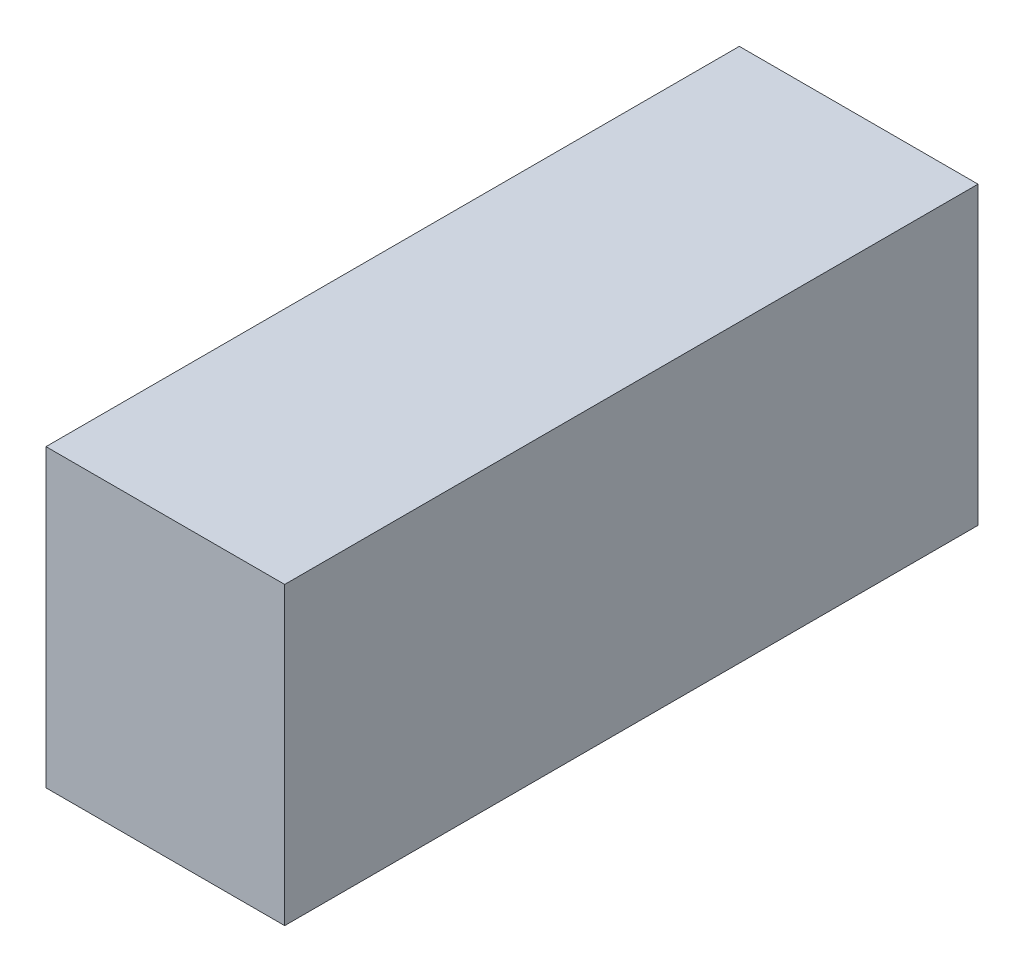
from build123d import *

# Parameters (mm, degrees)
BOSS_EXTRUDE1_DEPTH = 300
SKETCH2_W           = 105
SKETCH2_H           = 130
BOSS_EXTRUDE2_DEPTH = 5


with BuildPart() as part:
    # Sketch1 → Boss-Extrude1 (new body)
    with BuildSketch(Plane.XY):
        Polygon((-82.075023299, 62.148648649), (-82.075023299, 57.148648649), (17.924976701, 57.148648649), (17.924976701, -62.851351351), (-82.075023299, -62.851351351), (-82.075023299, -67.851351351), (22.924976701, -67.851351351), (22.924976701, 62.148648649), align=None)
    extrude(amount=BOSS_EXTRUDE1_DEPTH)

    # Sketch2 → Boss-Extrude2 (add)
    with BuildSketch(Plane.XY.offset(300)):
        with Locations((-29.575023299, -2.851351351)):
            Rectangle(SKETCH2_W, SKETCH2_H)
    extrude(amount=BOSS_EXTRUDE2_DEPTH)


solid = part.part
